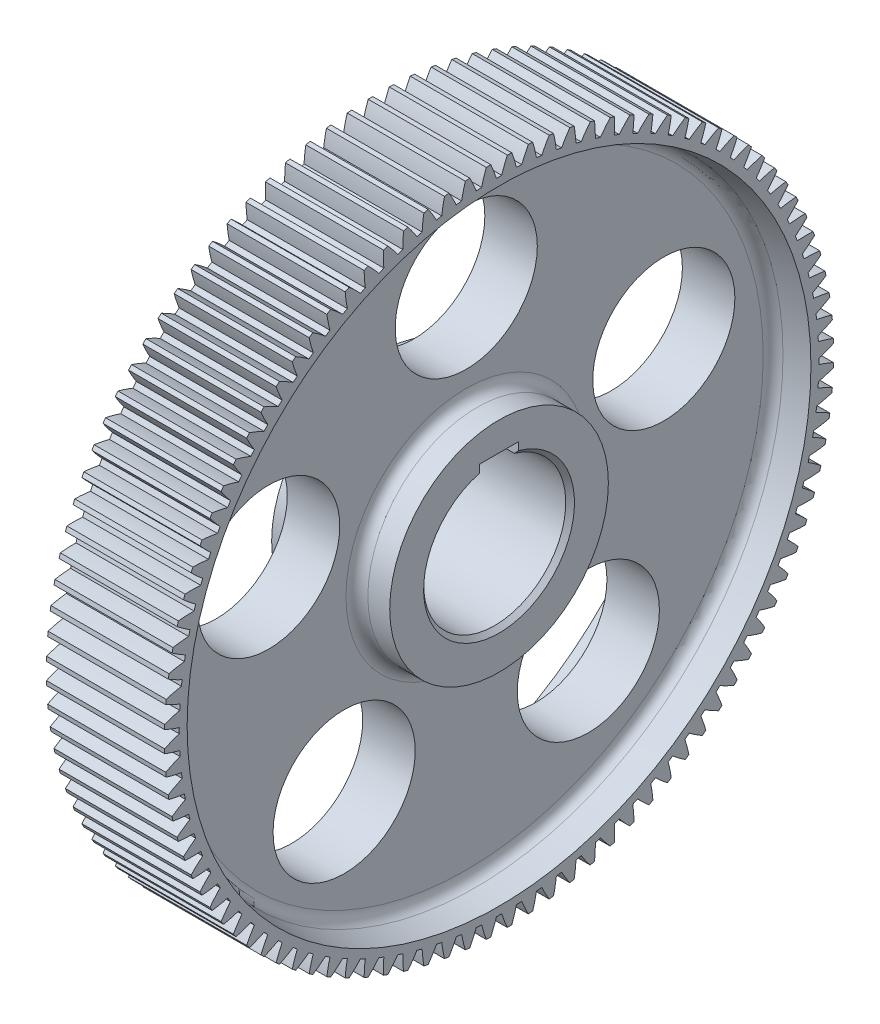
from build123d import *

# Parameters (mm, degrees)
BASPROSKE_W        = 54
BASPROSKE_H        = 153
TOOTHCUT_DEPTH     = 224.011210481
TEETHCUTS_COUNT    = 100
TEETHCUTS_ANGLE    = 356.4
BORE_REACH         = 224.947
BORSKE_R           = 32.5
CUT_EXTRUDE1_REACH = 221.796
SKETCH2_R          = 32.5
CIRPATTERN1_COUNT  = 5
FILLET1_R          = 5
CHAMFER1_SIZE      = 2
CUT_EXTRUDE2_REACH = 224.947
SKETCH3_W          = 18
SKETCH3_H          = 24.000203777


with BuildPart() as part:
    # BasProSke → Base-Revolve (revolve)
    with BuildSketch(Plane(origin=(0, 0, 0), x_dir=(1, 0, 0), z_dir=(0, 1, 0)), mode=Mode.PRIVATE) as base_revolve_sk:
        with Locations((27, 76.5)):
            Rectangle(BASPROSKE_W, BASPROSKE_H)
    revolve(base_revolve_sk.sketch.rotate(Axis((-10, 0, 0), (1, 0, 0)), 180), axis=Axis((-10, 0, 0), (1, 0, 0)))

    # TooCutSke → ToothCut (cut, through all)
    with BuildSketch(Plane(origin=(0, 0, 0), x_dir=(0, 0, -1), z_dir=(1, 0, 0))):
        with BuildLine():
            ThreePointArc((1.232724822, 146.243804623), (0, 146.249), (-1.232724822, 146.243804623))
            ThreePointArc((-1.232724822, 146.243804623), (-2.416723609, 149.649603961), (-3.803165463, 152.978132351))
            ThreePointArc((-3.803165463, 152.978132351), (0, 153.0254), (3.803165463, 152.978132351))
            ThreePointArc((3.803165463, 152.978132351), (2.416723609, 149.649603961), (1.232724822, 146.243804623))
        make_face()
    toothcut = extrude(amount=TOOTHCUT_DEPTH, mode=Mode.SUBTRACT)

    # TeethCuts: ToothCut ×100 about axis
    teethcuts_axis = Axis((-10, 0, 0), (1, 0, 0))
    for i in range(1, TEETHCUTS_COUNT):
        add(toothcut.rotate(teethcuts_axis, i * TEETHCUTS_ANGLE / (TEETHCUTS_COUNT - 1)), mode=Mode.SUBTRACT)

    # BorSke → Bore (cut, up to next)
    with BuildSketch(Plane(origin=(0, 0, 0), x_dir=(0, 0, -1), z_dir=(1, 0, 0)), mode=Mode.PRIVATE) as bore_sk1:
        with Locations(Location((0, 0, 0), (0, 0, 180))):
            Circle(BORSKE_R)
    bore_tool1 = extrude(bore_sk1.sketch, amount=BORE_REACH, mode=Mode.PRIVATE) & part.part
    add(bore_tool1.solids().sort_by_distance((0, 0, 0))[0], mode=Mode.SUBTRACT)

    # Sketch1 → Cut-Revolve1 (revolve, cut)
    with BuildSketch(Plane.XY, mode=Mode.PRIVATE) as cut_revolve1_sk:
        Polygon((54, 142.644904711), (39, 140), (39, 50), (54, 50), align=None)
    cut_revolve1 = revolve(cut_revolve1_sk.sketch.rotate(Axis((115.489533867, 0, 0), (-1, 0, 0)), 90), axis=Axis((115.489533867, 0, 0), (-1, 0, 0)), mode=Mode.SUBTRACT)

    # Mirror1: Cut-Revolve1 across plane
    add(cut_revolve1.mirror(Plane(origin=(27, 0, 0), x_dir=(0, 0, 1), z_dir=(1, 0, 0))), mode=Mode.SUBTRACT)

    # Sketch2 → Cut-Extrude1 (cut, up to next)
    with BuildSketch(Plane(origin=(39, 0, 0), x_dir=(0, 0, -1), z_dir=(1, 0, 0)), mode=Mode.PRIVATE) as cut_extrude1_sk1:
        with Locations((0, 95)):
            Circle(SKETCH2_R)
    cut_extrude1_tool1 = extrude(cut_extrude1_sk1.sketch, amount=-CUT_EXTRUDE1_REACH, mode=Mode.PRIVATE) & part.part
    cut_extrude1 = cut_extrude1_tool1.solids().sort_by_distance((39, 95, 0))[0]
    add(cut_extrude1, mode=Mode.SUBTRACT)

    # CirPattern1: Cut-Extrude1 ×5 about axis
    cirpattern1_axis = Axis((0, 0, 0), (1, 0, 0))
    for i in range(1, CIRPATTERN1_COUNT):
        add(cut_extrude1.rotate(cirpattern1_axis, i * 360 / CIRPATTERN1_COUNT), mode=Mode.SUBTRACT)

    # Fillet1
    fillet1_edges = [part.edges().sort_by_distance(p)[0] for p in [
        (39, 0, 50),
        (39, 0, 140),
        (15, 0, 50),
        (15, 0, 140),
    ]]
    fillet(fillet1_edges, radius=FILLET1_R)

    # Chamfer1
    chamfer1_edges = [part.edges().sort_by_distance(p)[0] for p in [
        (0, 0, -32.5),
        (54, 0, -32.5),
    ]]
    chamfer(chamfer1_edges, length=CHAMFER1_SIZE)

    # Sketch3 → Cut-Extrude2 (cut, up to next)
    with BuildSketch(Plane.ZY, mode=Mode.PRIVATE) as cut_extrude2_sk1:
        with Locations((0, 24.899898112)):
            Rectangle(SKETCH3_W, SKETCH3_H)
    cut_extrude2_tool1 = extrude(cut_extrude2_sk1.sketch, amount=-CUT_EXTRUDE2_REACH, mode=Mode.PRIVATE) & part.part
    add(cut_extrude2_tool1.solids().sort_by_distance((0, 24.899898, 0))[0], mode=Mode.SUBTRACT)


solid = part.part
